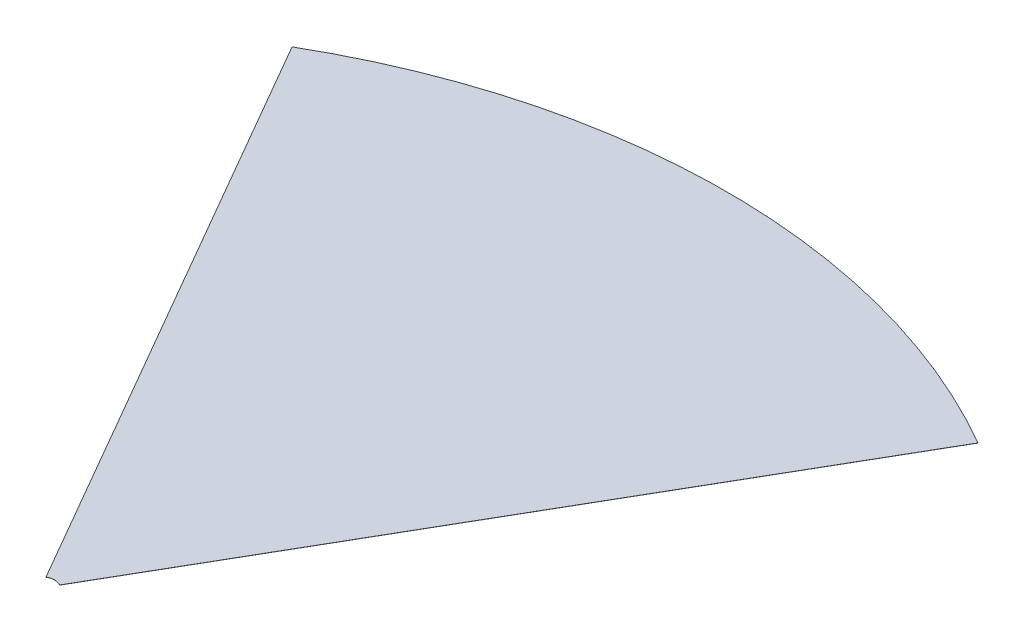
ISO-10303-21;
HEADER;
FILE_DESCRIPTION(('STEP AP214'),'2;1');
FILE_NAME('part.step','',(''),(''),'','','');
FILE_SCHEMA(('AUTOMOTIVE_DESIGN { 1 0 10303 214 1 1 1 1 }'));
ENDSEC;
DATA;
#1=APPLICATION_CONTEXT('core data for automotive mechanical design processes');
#2=APPLICATION_PROTOCOL_DEFINITION('international standard','automotive_design',2000,#1);
#3=PRODUCT_CONTEXT('',#1,'mechanical');
#4=PRODUCT('Part','Part','',(#3));
#5=PRODUCT_RELATED_PRODUCT_CATEGORY('part','',(#4));
#6=PRODUCT_DEFINITION_FORMATION('','',#4);
#7=PRODUCT_DEFINITION_CONTEXT('part definition',#1,'design');
#8=PRODUCT_DEFINITION('design','',#6,#7);
#9=PRODUCT_DEFINITION_SHAPE('','',#8);
#10=(LENGTH_UNIT() NAMED_UNIT(*) SI_UNIT(.MILLI.,.METRE.));
#11=(NAMED_UNIT(*) PLANE_ANGLE_UNIT() SI_UNIT($,.RADIAN.));
#12=(NAMED_UNIT(*) SI_UNIT($,.STERADIAN.) SOLID_ANGLE_UNIT());
#13=UNCERTAINTY_MEASURE_WITH_UNIT(LENGTH_MEASURE(1.E-05),#10,'distance_accuracy_value','');
#14=(GEOMETRIC_REPRESENTATION_CONTEXT(3) GLOBAL_UNCERTAINTY_ASSIGNED_CONTEXT((#13)) GLOBAL_UNIT_ASSIGNED_CONTEXT((#10,
#11,#12)) REPRESENTATION_CONTEXT('',''));
#15=CARTESIAN_POINT('',(0.,0.,0.));
#16=DIRECTION('',(0.,0.,1.));
#17=DIRECTION('',(1.,0.,0.));
#18=AXIS2_PLACEMENT_3D('',#15,#16,#17);
#19=CARTESIAN_POINT('',(0.,0.01,0.));
#20=DIRECTION('',(0.,-1.,0.));
#21=DIRECTION('',(0.,0.,-1.));
#22=AXIS2_PLACEMENT_3D('',#19,#20,#21);
#23=CYLINDRICAL_SURFACE('',#22,1.);
#24=CARTESIAN_POINT('',(0.,0.,0.));
#25=DIRECTION('',(0.,-1.,0.));
#26=DIRECTION('',(0.,0.,1.));
#27=AXIS2_PLACEMENT_3D('',#24,#25,#26);
#28=CIRCLE('',#27,1.);
#29=CARTESIAN_POINT('',(-0.499999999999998,0.,-0.86602540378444));
#30=VERTEX_POINT('',#29);
#31=CARTESIAN_POINT('',(0.499999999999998,0.,-0.86602540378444));
#32=VERTEX_POINT('',#31);
#33=EDGE_CURVE('E74',#30,#32,#28,.T.);
#34=ORIENTED_EDGE('',*,*,#33,.T.);
#35=DIRECTION('',(0.,-1.,0.));
#36=VECTOR('',#35,1.);
#37=CARTESIAN_POINT('',(0.499999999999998,0.01,-0.86602540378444));
#38=LINE('',#37,#36);
#39=CARTESIAN_POINT('',(0.499999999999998,0.01,-0.86602540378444));
#40=VERTEX_POINT('',#39);
#41=EDGE_CURVE('E11',#40,#32,#38,.T.);
#42=ORIENTED_EDGE('',*,*,#41,.F.);
#43=CARTESIAN_POINT('',(0.,0.01,0.));
#44=DIRECTION('',(0.,-1.,0.));
#45=DIRECTION('',(0.,0.,1.));
#46=AXIS2_PLACEMENT_3D('',#43,#44,#45);
#47=CIRCLE('',#46,1.);
#48=CARTESIAN_POINT('',(-0.499999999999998,0.01,-0.86602540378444));
#49=VERTEX_POINT('',#48);
#50=EDGE_CURVE('E92',#49,#40,#47,.T.);
#51=ORIENTED_EDGE('',*,*,#50,.F.);
#52=DIRECTION('',(0.,-1.,0.));
#53=VECTOR('',#52,1.);
#54=CARTESIAN_POINT('',(-0.499999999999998,0.01,-0.86602540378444));
#55=LINE('',#54,#53);
#56=EDGE_CURVE('E86',#49,#30,#55,.T.);
#57=ORIENTED_EDGE('',*,*,#56,.T.);
#58=EDGE_LOOP('',(#34,#42,#51,#57));
#59=FACE_BOUND('',#58,.T.);
#60=ADVANCED_FACE('F30',(#59),#23,.F.);
#61=CARTESIAN_POINT('',(0.499999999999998,0.01,-0.86602540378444));
#62=DIRECTION('',(-0.86602540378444,0.,-0.499999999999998));
#63=DIRECTION('',(-0.499999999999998,0.,0.86602540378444));
#64=AXIS2_PLACEMENT_3D('',#61,#62,#63);
#65=PLANE('',#64);
#66=DIRECTION('',(0.499999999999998,0.,-0.86602540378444));
#67=VECTOR('',#66,1.);
#68=CARTESIAN_POINT('',(0.499999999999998,0.,-0.86602540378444));
#69=LINE('',#68,#67);
#70=CARTESIAN_POINT('',(24.9999999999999,0.,-43.301270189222));
#71=VERTEX_POINT('',#70);
#72=EDGE_CURVE('E70',#32,#71,#69,.T.);
#73=ORIENTED_EDGE('',*,*,#72,.T.);
#74=DIRECTION('',(0.,-1.,0.));
#75=VECTOR('',#74,1.);
#76=CARTESIAN_POINT('',(24.9999999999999,0.01,-43.301270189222));
#77=LINE('',#76,#75);
#78=CARTESIAN_POINT('',(24.9999999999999,0.01,-43.301270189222));
#79=VERTEX_POINT('',#78);
#80=EDGE_CURVE('E37',#79,#71,#77,.T.);
#81=ORIENTED_EDGE('',*,*,#80,.F.);
#82=DIRECTION('',(0.499999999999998,0.,-0.86602540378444));
#83=VECTOR('',#82,1.);
#84=CARTESIAN_POINT('',(0.499999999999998,0.01,-0.86602540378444));
#85=LINE('',#84,#83);
#86=EDGE_CURVE('E82',#40,#79,#85,.T.);
#87=ORIENTED_EDGE('',*,*,#86,.F.);
#88=ORIENTED_EDGE('',*,*,#41,.T.);
#89=EDGE_LOOP('',(#73,#81,#87,#88));
#90=FACE_BOUND('',#89,.T.);
#91=ADVANCED_FACE('F81',(#90),#65,.F.);
#92=CARTESIAN_POINT('',(0.,0.01,0.));
#93=DIRECTION('',(0.,-1.,0.));
#94=DIRECTION('',(0.,0.,-1.));
#95=AXIS2_PLACEMENT_3D('',#92,#93,#94);
#96=CYLINDRICAL_SURFACE('',#95,50.);
#97=CARTESIAN_POINT('',(0.,0.,0.));
#98=DIRECTION('',(0.,1.,0.));
#99=DIRECTION('',(0.,0.,1.));
#100=AXIS2_PLACEMENT_3D('',#97,#98,#99);
#101=CIRCLE('',#100,50.);
#102=CARTESIAN_POINT('',(-24.9999999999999,0.,-43.301270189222));
#103=VERTEX_POINT('',#102);
#104=EDGE_CURVE('E75',#71,#103,#101,.T.);
#105=ORIENTED_EDGE('',*,*,#104,.T.);
#106=DIRECTION('',(0.,-1.,0.));
#107=VECTOR('',#106,1.);
#108=CARTESIAN_POINT('',(-24.9999999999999,0.01,-43.301270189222));
#109=LINE('',#108,#107);
#110=CARTESIAN_POINT('',(-24.9999999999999,0.01,-43.301270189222));
#111=VERTEX_POINT('',#110);
#112=EDGE_CURVE('E98',#111,#103,#109,.T.);
#113=ORIENTED_EDGE('',*,*,#112,.F.);
#114=CARTESIAN_POINT('',(0.,0.01,0.));
#115=DIRECTION('',(0.,1.,0.));
#116=DIRECTION('',(0.,0.,1.));
#117=AXIS2_PLACEMENT_3D('',#114,#115,#116);
#118=CIRCLE('',#117,50.);
#119=EDGE_CURVE('E49',#79,#111,#118,.T.);
#120=ORIENTED_EDGE('',*,*,#119,.F.);
#121=ORIENTED_EDGE('',*,*,#80,.T.);
#122=EDGE_LOOP('',(#105,#113,#120,#121));
#123=FACE_BOUND('',#122,.T.);
#124=ADVANCED_FACE('F101',(#123),#96,.T.);
#125=CARTESIAN_POINT('',(-0.499999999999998,0.01,-0.86602540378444));
#126=DIRECTION('',(0.86602540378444,0.,-0.499999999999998));
#127=DIRECTION('',(-0.499999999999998,0.,-0.86602540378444));
#128=AXIS2_PLACEMENT_3D('',#125,#126,#127);
#129=PLANE('',#128);
#130=DIRECTION('',(0.499999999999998,0.,0.86602540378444));
#131=VECTOR('',#130,1.);
#132=CARTESIAN_POINT('',(-0.499999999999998,0.,-0.86602540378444));
#133=LINE('',#132,#131);
#134=EDGE_CURVE('E90',#103,#30,#133,.T.);
#135=ORIENTED_EDGE('',*,*,#134,.T.);
#136=ORIENTED_EDGE('',*,*,#56,.F.);
#137=DIRECTION('',(0.499999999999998,0.,0.86602540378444));
#138=VECTOR('',#137,1.);
#139=CARTESIAN_POINT('',(-0.499999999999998,0.01,-0.86602540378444));
#140=LINE('',#139,#138);
#141=EDGE_CURVE('E44',#111,#49,#140,.T.);
#142=ORIENTED_EDGE('',*,*,#141,.F.);
#143=ORIENTED_EDGE('',*,*,#112,.T.);
#144=EDGE_LOOP('',(#135,#136,#142,#143));
#145=FACE_BOUND('',#144,.T.);
#146=ADVANCED_FACE('F103',(#145),#129,.F.);
#147=CARTESIAN_POINT('',(0.,0.01,0.));
#148=DIRECTION('',(0.,1.,0.));
#149=DIRECTION('',(0.,0.,1.));
#150=AXIS2_PLACEMENT_3D('',#147,#148,#149);
#151=PLANE('',#150);
#152=ORIENTED_EDGE('',*,*,#50,.T.);
#153=ORIENTED_EDGE('',*,*,#86,.T.);
#154=ORIENTED_EDGE('',*,*,#119,.T.);
#155=ORIENTED_EDGE('',*,*,#141,.T.);
#156=EDGE_LOOP('',(#152,#153,#154,#155));
#157=FACE_BOUND('',#156,.T.);
#158=ADVANCED_FACE('F104',(#157),#151,.T.);
#159=CARTESIAN_POINT('',(0.,0.,0.));
#160=DIRECTION('',(0.,1.,0.));
#161=DIRECTION('',(0.,0.,1.));
#162=AXIS2_PLACEMENT_3D('',#159,#160,#161);
#163=PLANE('',#162);
#164=ORIENTED_EDGE('',*,*,#33,.F.);
#165=ORIENTED_EDGE('',*,*,#134,.F.);
#166=ORIENTED_EDGE('',*,*,#104,.F.);
#167=ORIENTED_EDGE('',*,*,#72,.F.);
#168=EDGE_LOOP('',(#164,#165,#166,#167));
#169=FACE_BOUND('',#168,.T.);
#170=ADVANCED_FACE('F71',(#169),#163,.F.);
#171=CLOSED_SHELL('',(#60,#91,#124,#146,#158,#170));
#172=MANIFOLD_SOLID_BREP('B2',#171);
#173=ADVANCED_BREP_SHAPE_REPRESENTATION('',(#18,#172),#14);
#174=SHAPE_DEFINITION_REPRESENTATION(#9,#173);
ENDSEC;
END-ISO-10303-21;
